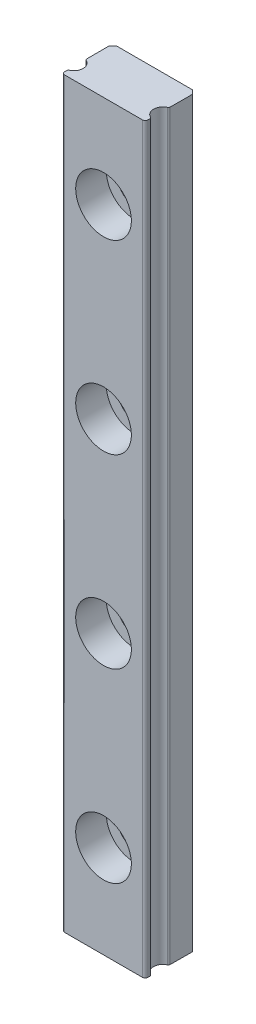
ISO-10303-21;
HEADER;
FILE_DESCRIPTION(('STEP AP214'),'2;1');
FILE_NAME('part.step','',(''),(''),'','','');
FILE_SCHEMA(('AUTOMOTIVE_DESIGN { 1 0 10303 214 1 1 1 1 }'));
ENDSEC;
DATA;
#1=APPLICATION_CONTEXT('core data for automotive mechanical design processes');
#2=APPLICATION_PROTOCOL_DEFINITION('international standard','automotive_design',2000,#1);
#3=PRODUCT_CONTEXT('',#1,'mechanical');
#4=PRODUCT('Part','Part','',(#3));
#5=PRODUCT_RELATED_PRODUCT_CATEGORY('part','',(#4));
#6=PRODUCT_DEFINITION_FORMATION('','',#4);
#7=PRODUCT_DEFINITION_CONTEXT('part definition',#1,'design');
#8=PRODUCT_DEFINITION('design','',#6,#7);
#9=PRODUCT_DEFINITION_SHAPE('','',#8);
#10=(LENGTH_UNIT() NAMED_UNIT(*) SI_UNIT(.MILLI.,.METRE.));
#11=(NAMED_UNIT(*) PLANE_ANGLE_UNIT() SI_UNIT($,.RADIAN.));
#12=(NAMED_UNIT(*) SI_UNIT($,.STERADIAN.) SOLID_ANGLE_UNIT());
#13=UNCERTAINTY_MEASURE_WITH_UNIT(LENGTH_MEASURE(1.E-05),#10,'distance_accuracy_value','');
#14=(GEOMETRIC_REPRESENTATION_CONTEXT(3) GLOBAL_UNCERTAINTY_ASSIGNED_CONTEXT((#13)) GLOBAL_UNIT_ASSIGNED_CONTEXT((#10,
#11,#12)) REPRESENTATION_CONTEXT('',''));
#15=CARTESIAN_POINT('',(0.,0.,0.));
#16=DIRECTION('',(0.,0.,1.));
#17=DIRECTION('',(1.,0.,0.));
#18=AXIS2_PLACEMENT_3D('',#15,#16,#17);
#19=CARTESIAN_POINT('',(55.5125,80.,4.99185481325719));
#20=DIRECTION('',(1.,0.,0.));
#21=DIRECTION('',(0.,0.,-1.));
#22=AXIS2_PLACEMENT_3D('',#19,#20,#21);
#23=PLANE('',#22);
#24=DIRECTION('',(0.,-1.,0.));
#25=VECTOR('',#24,1.);
#26=CARTESIAN_POINT('',(55.5125,80.,5.2));
#27=LINE('',#26,#25);
#28=CARTESIAN_POINT('',(55.5125,80.,5.2));
#29=VERTEX_POINT('',#28);
#30=CARTESIAN_POINT('',(55.5125,0.,5.2));
#31=VERTEX_POINT('',#30);
#32=EDGE_CURVE('E454',#29,#31,#27,.T.);
#33=ORIENTED_EDGE('',*,*,#32,.F.);
#34=DIRECTION('',(0.,0.,-1.));
#35=VECTOR('',#34,1.);
#36=CARTESIAN_POINT('',(55.5125,80.,4.99185481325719));
#37=LINE('',#36,#35);
#38=CARTESIAN_POINT('',(55.5125,80.,4.99185481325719));
#39=VERTEX_POINT('',#38);
#40=EDGE_CURVE('E515',#39,#29,#37,.F.);
#41=ORIENTED_EDGE('',*,*,#40,.F.);
#42=DIRECTION('',(0.,-1.,0.));
#43=VECTOR('',#42,1.);
#44=CARTESIAN_POINT('',(55.5125,80.,4.99185481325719));
#45=LINE('',#44,#43);
#46=CARTESIAN_POINT('',(55.5125,0.,4.99185481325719));
#47=VERTEX_POINT('',#46);
#48=EDGE_CURVE('E527',#47,#39,#45,.F.);
#49=ORIENTED_EDGE('',*,*,#48,.F.);
#50=DIRECTION('',(0.,0.,-1.));
#51=VECTOR('',#50,1.);
#52=CARTESIAN_POINT('',(55.5125,0.,4.99185481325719));
#53=LINE('',#52,#51);
#54=EDGE_CURVE('E465',#31,#47,#53,.T.);
#55=ORIENTED_EDGE('',*,*,#54,.F.);
#56=EDGE_LOOP('',(#33,#41,#49,#55));
#57=FACE_BOUND('',#56,.T.);
#58=ADVANCED_FACE('F17',(#57),#23,.F.);
#59=CARTESIAN_POINT('',(64.4875,80.,5.2));
#60=DIRECTION('',(-1.,0.,0.));
#61=DIRECTION('',(0.,0.,1.));
#62=AXIS2_PLACEMENT_3D('',#59,#60,#61);
#63=PLANE('',#62);
#64=DIRECTION('',(0.,-1.,0.));
#65=VECTOR('',#64,1.);
#66=CARTESIAN_POINT('',(64.4875,80.,4.99185481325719));
#67=LINE('',#66,#65);
#68=CARTESIAN_POINT('',(64.4875,80.,4.99185481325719));
#69=VERTEX_POINT('',#68);
#70=CARTESIAN_POINT('',(64.4875,0.,4.99185481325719));
#71=VERTEX_POINT('',#70);
#72=EDGE_CURVE('E268',#69,#71,#67,.T.);
#73=ORIENTED_EDGE('',*,*,#72,.F.);
#74=DIRECTION('',(0.,0.,1.));
#75=VECTOR('',#74,1.);
#76=CARTESIAN_POINT('',(64.4875,80.,5.2));
#77=LINE('',#76,#75);
#78=CARTESIAN_POINT('',(64.4875,80.,5.2));
#79=VERTEX_POINT('',#78);
#80=EDGE_CURVE('E461',#79,#69,#77,.F.);
#81=ORIENTED_EDGE('',*,*,#80,.F.);
#82=DIRECTION('',(0.,-1.,0.));
#83=VECTOR('',#82,1.);
#84=CARTESIAN_POINT('',(64.4875,80.,5.2));
#85=LINE('',#84,#83);
#86=CARTESIAN_POINT('',(64.4875,0.,5.2));
#87=VERTEX_POINT('',#86);
#88=EDGE_CURVE('E446',#87,#79,#85,.F.);
#89=ORIENTED_EDGE('',*,*,#88,.F.);
#90=DIRECTION('',(0.,0.,1.));
#91=VECTOR('',#90,1.);
#92=CARTESIAN_POINT('',(64.4875,0.,5.2));
#93=LINE('',#92,#91);
#94=EDGE_CURVE('E464',#71,#87,#93,.T.);
#95=ORIENTED_EDGE('',*,*,#94,.F.);
#96=EDGE_LOOP('',(#73,#81,#89,#95));
#97=FACE_BOUND('',#96,.T.);
#98=ADVANCED_FACE('F713',(#97),#63,.F.);
#99=CARTESIAN_POINT('',(64.2875,80.,4.99185481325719));
#100=DIRECTION('',(0.,-1.,0.));
#101=DIRECTION('',(0.,0.,-1.));
#102=AXIS2_PLACEMENT_3D('',#99,#100,#101);
#103=CYLINDRICAL_SURFACE('',#102,0.2);
#104=CARTESIAN_POINT('',(64.2875,80.,4.99185481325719));
#105=DIRECTION('',(0.,-1.,0.));
#106=DIRECTION('',(0.424904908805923,0.,-0.905237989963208));
#107=AXIS2_PLACEMENT_3D('',#104,#105,#106);
#108=CIRCLE('',#107,0.2);
#109=CARTESIAN_POINT('',(64.3724809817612,80.,4.81080721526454));
#110=VERTEX_POINT('',#109);
#111=EDGE_CURVE('E263',#110,#69,#108,.T.);
#112=ORIENTED_EDGE('',*,*,#111,.T.);
#113=ORIENTED_EDGE('',*,*,#72,.T.);
#114=CARTESIAN_POINT('',(64.2875,0.,4.99185481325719));
#115=DIRECTION('',(0.,1.,0.));
#116=DIRECTION('',(1.,0.,0.));
#117=AXIS2_PLACEMENT_3D('',#114,#115,#116);
#118=CIRCLE('',#117,0.200000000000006);
#119=CARTESIAN_POINT('',(64.3724809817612,0.,4.81080721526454));
#120=VERTEX_POINT('',#119);
#121=EDGE_CURVE('E280',#71,#120,#118,.T.);
#122=ORIENTED_EDGE('',*,*,#121,.T.);
#123=DIRECTION('',(0.,-1.,0.));
#124=VECTOR('',#123,1.);
#125=CARTESIAN_POINT('',(64.3724809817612,80.,4.81080721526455));
#126=LINE('',#125,#124);
#127=EDGE_CURVE('E440',#120,#110,#126,.F.);
#128=ORIENTED_EDGE('',*,*,#127,.T.);
#129=EDGE_LOOP('',(#112,#113,#122,#128));
#130=FACE_BOUND('',#129,.T.);
#131=ADVANCED_FACE('F231',(#130),#103,.T.);
#132=CARTESIAN_POINT('',(64.2875,80.,2.80814518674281));
#133=DIRECTION('',(0.,-1.,0.));
#134=DIRECTION('',(0.,0.,-1.));
#135=AXIS2_PLACEMENT_3D('',#132,#133,#134);
#136=CYLINDRICAL_SURFACE('',#135,0.2);
#137=CARTESIAN_POINT('',(64.2875,80.,2.80814518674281));
#138=DIRECTION('',(0.,-1.,0.));
#139=DIRECTION('',(1.,0.,0.));
#140=AXIS2_PLACEMENT_3D('',#137,#138,#139);
#141=CIRCLE('',#140,0.200000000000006);
#142=CARTESIAN_POINT('',(64.49375,80.,2.80814518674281));
#143=VERTEX_POINT('',#142);
#144=CARTESIAN_POINT('',(64.3724809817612,80.,2.98919278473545));
#145=VERTEX_POINT('',#144);
#146=EDGE_CURVE('E571',#143,#145,#141,.T.);
#147=ORIENTED_EDGE('',*,*,#146,.T.);
#148=DIRECTION('',(0.,-1.,0.));
#149=VECTOR('',#148,1.);
#150=CARTESIAN_POINT('',(64.3724809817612,80.,2.98919278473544));
#151=LINE('',#150,#149);
#152=CARTESIAN_POINT('',(64.3724809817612,0.,2.98919278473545));
#153=VERTEX_POINT('',#152);
#154=EDGE_CURVE('E437',#145,#153,#151,.T.);
#155=ORIENTED_EDGE('',*,*,#154,.T.);
#156=CARTESIAN_POINT('',(64.2875,0.,2.80814518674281));
#157=DIRECTION('',(0.,1.,0.));
#158=DIRECTION('',(0.424904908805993,0.,0.905237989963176));
#159=AXIS2_PLACEMENT_3D('',#156,#157,#158);
#160=CIRCLE('',#159,0.2);
#161=CARTESIAN_POINT('',(64.49375,0.,2.80814518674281));
#162=VERTEX_POINT('',#161);
#163=EDGE_CURVE('E250',#153,#162,#160,.T.);
#164=ORIENTED_EDGE('',*,*,#163,.T.);
#165=CARTESIAN_POINT('',(64.4875,0.,2.80814518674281));
#166=DIRECTION('',(0.,1.,0.));
#167=VECTOR('',#166,1.);
#168=LINE('',#165,#167);
#169=EDGE_CURVE('E213',#162,#143,#168,.T.);
#170=ORIENTED_EDGE('',*,*,#169,.T.);
#171=EDGE_LOOP('',(#147,#155,#164,#170));
#172=FACE_BOUND('',#171,.T.);
#173=ADVANCED_FACE('F220',(#172),#136,.T.);
#174=CARTESIAN_POINT('',(55.7125,80.,2.80814518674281));
#175=DIRECTION('',(0.,-1.,0.));
#176=DIRECTION('',(0.,0.,-1.));
#177=AXIS2_PLACEMENT_3D('',#174,#175,#176);
#178=CYLINDRICAL_SURFACE('',#177,0.2);
#179=CARTESIAN_POINT('',(55.7125,80.,2.80814518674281));
#180=DIRECTION('',(0.,-1.,0.));
#181=DIRECTION('',(-0.424904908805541,0.,0.905237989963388));
#182=AXIS2_PLACEMENT_3D('',#179,#180,#181);
#183=CIRCLE('',#182,0.2);
#184=CARTESIAN_POINT('',(55.6275190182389,80.,2.98919278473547));
#185=VERTEX_POINT('',#184);
#186=CARTESIAN_POINT('',(55.50625,80.,2.80814518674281));
#187=VERTEX_POINT('',#186);
#188=EDGE_CURVE('E549',#185,#187,#183,.T.);
#189=ORIENTED_EDGE('',*,*,#188,.T.);
#190=CARTESIAN_POINT('',(55.5125,80.,2.80814518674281));
#191=DIRECTION('',(0.,-1.,0.));
#192=VECTOR('',#191,1.);
#193=LINE('',#190,#192);
#194=CARTESIAN_POINT('',(55.50625,0.,2.80814518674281));
#195=VERTEX_POINT('',#194);
#196=EDGE_CURVE('E133',#187,#195,#193,.T.);
#197=ORIENTED_EDGE('',*,*,#196,.T.);
#198=CARTESIAN_POINT('',(55.7125,0.,2.80814518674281));
#199=DIRECTION('',(0.,1.,0.));
#200=DIRECTION('',(-1.,0.,0.));
#201=AXIS2_PLACEMENT_3D('',#198,#199,#200);
#202=CIRCLE('',#201,0.199999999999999);
#203=CARTESIAN_POINT('',(55.6275190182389,0.,2.98919278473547));
#204=VERTEX_POINT('',#203);
#205=EDGE_CURVE('E558',#195,#204,#202,.T.);
#206=ORIENTED_EDGE('',*,*,#205,.T.);
#207=DIRECTION('',(0.,-1.,0.));
#208=VECTOR('',#207,1.);
#209=CARTESIAN_POINT('',(55.6275190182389,80.,2.98919278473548));
#210=LINE('',#209,#208);
#211=EDGE_CURVE('E409',#204,#185,#210,.F.);
#212=ORIENTED_EDGE('',*,*,#211,.T.);
#213=EDGE_LOOP('',(#189,#197,#206,#212));
#214=FACE_BOUND('',#213,.T.);
#215=ADVANCED_FACE('F230',(#214),#178,.T.);
#216=CARTESIAN_POINT('',(55.7125,80.,4.99185481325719));
#217=DIRECTION('',(0.,-1.,0.));
#218=DIRECTION('',(0.,0.,-1.));
#219=AXIS2_PLACEMENT_3D('',#216,#217,#218);
#220=CYLINDRICAL_SURFACE('',#219,0.2);
#221=CARTESIAN_POINT('',(55.7125,80.,4.99185481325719));
#222=DIRECTION('',(0.,-1.,0.));
#223=DIRECTION('',(-1.,0.,0.));
#224=AXIS2_PLACEMENT_3D('',#221,#222,#223);
#225=CIRCLE('',#224,0.199999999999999);
#226=CARTESIAN_POINT('',(55.6275190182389,80.,4.81080721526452));
#227=VERTEX_POINT('',#226);
#228=EDGE_CURVE('E522',#39,#227,#225,.T.);
#229=ORIENTED_EDGE('',*,*,#228,.T.);
#230=DIRECTION('',(0.,-1.,0.));
#231=VECTOR('',#230,1.);
#232=CARTESIAN_POINT('',(55.6275190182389,80.,4.81080721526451));
#233=LINE('',#232,#231);
#234=CARTESIAN_POINT('',(55.6275190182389,0.,4.81080721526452));
#235=VERTEX_POINT('',#234);
#236=EDGE_CURVE('E399',#227,#235,#233,.T.);
#237=ORIENTED_EDGE('',*,*,#236,.T.);
#238=CARTESIAN_POINT('',(55.7125,0.,4.99185481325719));
#239=DIRECTION('',(0.,1.,0.));
#240=DIRECTION('',(-0.424904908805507,0.,-0.905237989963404));
#241=AXIS2_PLACEMENT_3D('',#238,#239,#240);
#242=CIRCLE('',#241,0.2);
#243=EDGE_CURVE('E535',#235,#47,#242,.T.);
#244=ORIENTED_EDGE('',*,*,#243,.T.);
#245=ORIENTED_EDGE('',*,*,#48,.T.);
#246=EDGE_LOOP('',(#229,#237,#244,#245));
#247=FACE_BOUND('',#246,.T.);
#248=ADVANCED_FACE('F494',(#247),#220,.T.);
#249=CARTESIAN_POINT('',(55.8125,80.,5.2));
#250=DIRECTION('',(0.,-1.,0.));
#251=DIRECTION('',(0.,0.,-1.));
#252=AXIS2_PLACEMENT_3D('',#249,#250,#251);
#253=CYLINDRICAL_SURFACE('',#252,0.3);
#254=CARTESIAN_POINT('',(55.8125,80.,5.2));
#255=DIRECTION('',(0.,-1.,0.));
#256=DIRECTION('',(0.,0.,1.));
#257=AXIS2_PLACEMENT_3D('',#254,#255,#256);
#258=CIRCLE('',#257,0.3);
#259=CARTESIAN_POINT('',(55.8125,80.,5.5));
#260=VERTEX_POINT('',#259);
#261=EDGE_CURVE('E627',#260,#29,#258,.T.);
#262=ORIENTED_EDGE('',*,*,#261,.T.);
#263=ORIENTED_EDGE('',*,*,#32,.T.);
#264=CARTESIAN_POINT('',(55.8125,0.,5.2));
#265=DIRECTION('',(0.,1.,0.));
#266=DIRECTION('',(-1.,0.,0.));
#267=AXIS2_PLACEMENT_3D('',#264,#265,#266);
#268=CIRCLE('',#267,0.300000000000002);
#269=CARTESIAN_POINT('',(55.8125,0.,5.5));
#270=VERTEX_POINT('',#269);
#271=EDGE_CURVE('E666',#31,#270,#268,.T.);
#272=ORIENTED_EDGE('',*,*,#271,.T.);
#273=DIRECTION('',(0.,1.,0.));
#274=VECTOR('',#273,1.);
#275=CARTESIAN_POINT('',(55.8125,80.,5.5));
#276=LINE('',#275,#274);
#277=EDGE_CURVE('E392',#270,#260,#276,.T.);
#278=ORIENTED_EDGE('',*,*,#277,.T.);
#279=EDGE_LOOP('',(#262,#263,#272,#278));
#280=FACE_BOUND('',#279,.T.);
#281=ADVANCED_FACE('F489',(#280),#253,.T.);
#282=CARTESIAN_POINT('',(64.1875,80.,5.2));
#283=DIRECTION('',(0.,-1.,0.));
#284=DIRECTION('',(0.,0.,-1.));
#285=AXIS2_PLACEMENT_3D('',#282,#283,#284);
#286=CYLINDRICAL_SURFACE('',#285,0.3);
#287=CARTESIAN_POINT('',(64.1875,80.,5.2));
#288=DIRECTION('',(0.,-1.,0.));
#289=DIRECTION('',(1.,0.,0.));
#290=AXIS2_PLACEMENT_3D('',#287,#288,#289);
#291=CIRCLE('',#290,0.299999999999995);
#292=CARTESIAN_POINT('',(64.1875,80.,5.5));
#293=VERTEX_POINT('',#292);
#294=EDGE_CURVE('E443',#79,#293,#291,.T.);
#295=ORIENTED_EDGE('',*,*,#294,.T.);
#296=DIRECTION('',(0.,1.,0.));
#297=VECTOR('',#296,1.);
#298=CARTESIAN_POINT('',(64.1875,80.,5.5));
#299=LINE('',#298,#297);
#300=CARTESIAN_POINT('',(64.1875,0.,5.5));
#301=VERTEX_POINT('',#300);
#302=EDGE_CURVE('E387',#293,#301,#299,.F.);
#303=ORIENTED_EDGE('',*,*,#302,.T.);
#304=CARTESIAN_POINT('',(64.1875,0.,5.2));
#305=DIRECTION('',(0.,1.,0.));
#306=DIRECTION('',(0.,0.,1.));
#307=AXIS2_PLACEMENT_3D('',#304,#305,#306);
#308=CIRCLE('',#307,0.3);
#309=EDGE_CURVE('E450',#301,#87,#308,.T.);
#310=ORIENTED_EDGE('',*,*,#309,.T.);
#311=ORIENTED_EDGE('',*,*,#88,.T.);
#312=EDGE_LOOP('',(#295,#303,#310,#311));
#313=FACE_BOUND('',#312,.T.);
#314=ADVANCED_FACE('F478',(#313),#286,.T.);
#315=CARTESIAN_POINT('',(60.,70.,5.5));
#316=DIRECTION('',(0.,0.,-1.));
#317=DIRECTION('',(-1.,0.,0.));
#318=AXIS2_PLACEMENT_3D('',#315,#316,#317);
#319=CYLINDRICAL_SURFACE('',#318,3.);
#320=CARTESIAN_POINT('',(60.,70.,2.2));
#321=DIRECTION('',(0.,0.,-1.));
#322=DIRECTION('',(-1.,0.,0.));
#323=AXIS2_PLACEMENT_3D('',#320,#321,#322);
#324=CIRCLE('',#323,3.);
#325=CARTESIAN_POINT('',(57.,70.,2.2));
#326=VERTEX_POINT('',#325);
#327=EDGE_CURVE('E369',#326,#326,#324,.F.);
#328=ORIENTED_EDGE('',*,*,#327,.F.);
#329=EDGE_LOOP('',(#328));
#330=FACE_BOUND('',#329,.T.);
#331=CARTESIAN_POINT('',(60.,70.,5.5));
#332=DIRECTION('',(0.,0.,-1.));
#333=DIRECTION('',(-1.,0.,0.));
#334=AXIS2_PLACEMENT_3D('',#331,#332,#333);
#335=CIRCLE('',#334,3.);
#336=CARTESIAN_POINT('',(57.,70.,5.5));
#337=VERTEX_POINT('',#336);
#338=EDGE_CURVE('E377',#337,#337,#335,.F.);
#339=ORIENTED_EDGE('',*,*,#338,.T.);
#340=EDGE_LOOP('',(#339));
#341=FACE_BOUND('',#340,.T.);
#342=ADVANCED_FACE('F488',(#330,#341),#319,.F.);
#343=CARTESIAN_POINT('',(60.,30.,5.5));
#344=DIRECTION('',(0.,0.,-1.));
#345=DIRECTION('',(-1.,0.,0.));
#346=AXIS2_PLACEMENT_3D('',#343,#344,#345);
#347=CYLINDRICAL_SURFACE('',#346,3.);
#348=CARTESIAN_POINT('',(60.,30.,2.2));
#349=DIRECTION('',(0.,0.,-1.));
#350=DIRECTION('',(-1.,0.,0.));
#351=AXIS2_PLACEMENT_3D('',#348,#349,#350);
#352=CIRCLE('',#351,3.);
#353=CARTESIAN_POINT('',(57.,30.,2.2));
#354=VERTEX_POINT('',#353);
#355=EDGE_CURVE('E365',#354,#354,#352,.F.);
#356=ORIENTED_EDGE('',*,*,#355,.F.);
#357=EDGE_LOOP('',(#356));
#358=FACE_BOUND('',#357,.T.);
#359=CARTESIAN_POINT('',(60.,30.,5.5));
#360=DIRECTION('',(0.,0.,-1.));
#361=DIRECTION('',(-1.,0.,0.));
#362=AXIS2_PLACEMENT_3D('',#359,#360,#361);
#363=CIRCLE('',#362,3.);
#364=CARTESIAN_POINT('',(57.,30.,5.5));
#365=VERTEX_POINT('',#364);
#366=EDGE_CURVE('E380',#365,#365,#363,.F.);
#367=ORIENTED_EDGE('',*,*,#366,.T.);
#368=EDGE_LOOP('',(#367));
#369=FACE_BOUND('',#368,.T.);
#370=ADVANCED_FACE('F790',(#358,#369),#347,.F.);
#371=CARTESIAN_POINT('',(60.,9.99999999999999,5.5));
#372=DIRECTION('',(0.,0.,-1.));
#373=DIRECTION('',(-1.,0.,0.));
#374=AXIS2_PLACEMENT_3D('',#371,#372,#373);
#375=CYLINDRICAL_SURFACE('',#374,3.);
#376=CARTESIAN_POINT('',(60.,9.99999999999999,2.2));
#377=DIRECTION('',(0.,0.,-1.));
#378=DIRECTION('',(-1.,0.,0.));
#379=AXIS2_PLACEMENT_3D('',#376,#377,#378);
#380=CIRCLE('',#379,3.);
#381=CARTESIAN_POINT('',(57.,9.99999999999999,2.2));
#382=VERTEX_POINT('',#381);
#383=EDGE_CURVE('E361',#382,#382,#380,.F.);
#384=ORIENTED_EDGE('',*,*,#383,.F.);
#385=EDGE_LOOP('',(#384));
#386=FACE_BOUND('',#385,.T.);
#387=CARTESIAN_POINT('',(60.,9.99999999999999,5.5));
#388=DIRECTION('',(0.,0.,-1.));
#389=DIRECTION('',(-1.,0.,0.));
#390=AXIS2_PLACEMENT_3D('',#387,#388,#389);
#391=CIRCLE('',#390,3.);
#392=CARTESIAN_POINT('',(57.,9.99999999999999,5.5));
#393=VERTEX_POINT('',#392);
#394=EDGE_CURVE('E20',#393,#393,#391,.F.);
#395=ORIENTED_EDGE('',*,*,#394,.T.);
#396=EDGE_LOOP('',(#395));
#397=FACE_BOUND('',#396,.T.);
#398=ADVANCED_FACE('F795',(#386,#397),#375,.F.);
#399=CARTESIAN_POINT('',(60.,50.,5.5));
#400=DIRECTION('',(0.,0.,-1.));
#401=DIRECTION('',(-1.,0.,0.));
#402=AXIS2_PLACEMENT_3D('',#399,#400,#401);
#403=CYLINDRICAL_SURFACE('',#402,3.);
#404=CARTESIAN_POINT('',(60.,50.,2.2));
#405=DIRECTION('',(0.,0.,-1.));
#406=DIRECTION('',(-1.,0.,0.));
#407=AXIS2_PLACEMENT_3D('',#404,#405,#406);
#408=CIRCLE('',#407,3.);
#409=CARTESIAN_POINT('',(57.,50.,2.2));
#410=VERTEX_POINT('',#409);
#411=EDGE_CURVE('E357',#410,#410,#408,.F.);
#412=ORIENTED_EDGE('',*,*,#411,.F.);
#413=EDGE_LOOP('',(#412));
#414=FACE_BOUND('',#413,.T.);
#415=CARTESIAN_POINT('',(60.,50.,5.5));
#416=DIRECTION('',(0.,0.,-1.));
#417=DIRECTION('',(-1.,0.,0.));
#418=AXIS2_PLACEMENT_3D('',#415,#416,#417);
#419=CIRCLE('',#418,3.);
#420=CARTESIAN_POINT('',(57.,50.,5.5));
#421=VERTEX_POINT('',#420);
#422=EDGE_CURVE('E373',#421,#421,#419,.F.);
#423=ORIENTED_EDGE('',*,*,#422,.T.);
#424=EDGE_LOOP('',(#423));
#425=FACE_BOUND('',#424,.T.);
#426=ADVANCED_FACE('F802',(#414,#425),#403,.F.);
#427=CARTESIAN_POINT('',(64.8,80.,3.9));
#428=DIRECTION('',(0.,-1.,0.));
#429=DIRECTION('',(0.,0.,-1.));
#430=AXIS2_PLACEMENT_3D('',#427,#428,#429);
#431=CYLINDRICAL_SURFACE('',#430,1.00615222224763);
#432=ORIENTED_EDGE('',*,*,#154,.F.);
#433=CARTESIAN_POINT('',(64.8,80.,3.9));
#434=DIRECTION('',(0.,-1.,0.));
#435=DIRECTION('',(0.,0.,-1.));
#436=AXIS2_PLACEMENT_3D('',#433,#434,#435);
#437=CIRCLE('',#436,1.00615222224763);
#438=EDGE_CURVE('E348',#110,#145,#437,.T.);
#439=ORIENTED_EDGE('',*,*,#438,.F.);
#440=ORIENTED_EDGE('',*,*,#127,.F.);
#441=CARTESIAN_POINT('',(64.8,0.,3.9));
#442=DIRECTION('',(0.,-1.,0.));
#443=DIRECTION('',(0.,0.,-1.));
#444=AXIS2_PLACEMENT_3D('',#441,#442,#443);
#445=CIRCLE('',#444,1.00615222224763);
#446=EDGE_CURVE('E147',#120,#153,#445,.T.);
#447=ORIENTED_EDGE('',*,*,#446,.T.);
#448=EDGE_LOOP('',(#432,#439,#440,#447));
#449=FACE_BOUND('',#448,.T.);
#450=ADVANCED_FACE('F196',(#449),#431,.F.);
#451=CARTESIAN_POINT('',(64.5,80.,2.80814518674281));
#452=DIRECTION('',(-1.,0.,0.));
#453=DIRECTION('',(0.,0.,1.));
#454=AXIS2_PLACEMENT_3D('',#451,#452,#453);
#455=PLANE('',#454);
#456=DIRECTION('',(0.,1.,0.));
#457=VECTOR('',#456,1.);
#458=CARTESIAN_POINT('',(64.5,80.,0.412499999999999));
#459=LINE('',#458,#457);
#460=CARTESIAN_POINT('',(64.5,0.,0.412499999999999));
#461=VERTEX_POINT('',#460);
#462=CARTESIAN_POINT('',(64.5,80.,0.412499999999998));
#463=VERTEX_POINT('',#462);
#464=EDGE_CURVE('E354',#461,#463,#459,.T.);
#465=ORIENTED_EDGE('',*,*,#464,.T.);
#466=DIRECTION('',(0.,0.,-1.));
#467=VECTOR('',#466,1.);
#468=CARTESIAN_POINT('',(64.5,80.,2.80814518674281));
#469=LINE('',#468,#467);
#470=EDGE_CURVE('E174',#143,#463,#469,.T.);
#471=ORIENTED_EDGE('',*,*,#470,.F.);
#472=ORIENTED_EDGE('',*,*,#169,.F.);
#473=DIRECTION('',(0.,0.,1.));
#474=VECTOR('',#473,1.);
#475=CARTESIAN_POINT('',(64.5,0.,2.80814518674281));
#476=LINE('',#475,#474);
#477=EDGE_CURVE('E326',#162,#461,#476,.F.);
#478=ORIENTED_EDGE('',*,*,#477,.T.);
#479=EDGE_LOOP('',(#465,#471,#472,#478));
#480=FACE_BOUND('',#479,.T.);
#481=ADVANCED_FACE('F191',(#480),#455,.F.);
#482=CARTESIAN_POINT('',(55.5,80.,0.4));
#483=DIRECTION('',(1.,0.,0.));
#484=DIRECTION('',(0.,0.,-1.));
#485=AXIS2_PLACEMENT_3D('',#482,#483,#484);
#486=PLANE('',#485);
#487=ORIENTED_EDGE('',*,*,#196,.F.);
#488=DIRECTION('',(0.,0.,1.));
#489=VECTOR('',#488,1.);
#490=CARTESIAN_POINT('',(55.5,80.,0.4));
#491=LINE('',#490,#489);
#492=CARTESIAN_POINT('',(55.5,80.,0.412500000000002));
#493=VERTEX_POINT('',#492);
#494=EDGE_CURVE('E127',#493,#187,#491,.T.);
#495=ORIENTED_EDGE('',*,*,#494,.F.);
#496=DIRECTION('',(0.,1.,0.));
#497=VECTOR('',#496,1.);
#498=CARTESIAN_POINT('',(55.5,80.,0.412500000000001));
#499=LINE('',#498,#497);
#500=CARTESIAN_POINT('',(55.5,0.,0.412499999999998));
#501=VERTEX_POINT('',#500);
#502=EDGE_CURVE('E131',#493,#501,#499,.F.);
#503=ORIENTED_EDGE('',*,*,#502,.T.);
#504=DIRECTION('',(0.,0.,1.));
#505=VECTOR('',#504,1.);
#506=CARTESIAN_POINT('',(55.5,0.,4.99185481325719));
#507=LINE('',#506,#505);
#508=EDGE_CURVE('E323',#501,#195,#507,.T.);
#509=ORIENTED_EDGE('',*,*,#508,.T.);
#510=EDGE_LOOP('',(#487,#495,#503,#509));
#511=FACE_BOUND('',#510,.T.);
#512=ADVANCED_FACE('F129',(#511),#486,.F.);
#513=CARTESIAN_POINT('',(55.2,80.,3.9));
#514=DIRECTION('',(0.,-1.,0.));
#515=DIRECTION('',(0.,0.,-1.));
#516=AXIS2_PLACEMENT_3D('',#513,#514,#515);
#517=CYLINDRICAL_SURFACE('',#516,1.00615222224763);
#518=ORIENTED_EDGE('',*,*,#236,.F.);
#519=CARTESIAN_POINT('',(55.2,80.,3.9));
#520=DIRECTION('',(0.,-1.,0.));
#521=DIRECTION('',(0.,0.,-1.));
#522=AXIS2_PLACEMENT_3D('',#519,#520,#521);
#523=CIRCLE('',#522,1.00615222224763);
#524=EDGE_CURVE('E138',#185,#227,#523,.T.);
#525=ORIENTED_EDGE('',*,*,#524,.F.);
#526=ORIENTED_EDGE('',*,*,#211,.F.);
#527=CARTESIAN_POINT('',(55.2,0.,3.9));
#528=DIRECTION('',(0.,-1.,0.));
#529=DIRECTION('',(0.,0.,-1.));
#530=AXIS2_PLACEMENT_3D('',#527,#528,#529);
#531=CIRCLE('',#530,1.00615222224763);
#532=EDGE_CURVE('E319',#204,#235,#531,.T.);
#533=ORIENTED_EDGE('',*,*,#532,.T.);
#534=EDGE_LOOP('',(#518,#525,#526,#533));
#535=FACE_BOUND('',#534,.T.);
#536=ADVANCED_FACE('F190',(#535),#517,.F.);
#537=CARTESIAN_POINT('',(55.8125,80.,5.5));
#538=DIRECTION('',(0.,0.,-1.));
#539=DIRECTION('',(-1.,0.,0.));
#540=AXIS2_PLACEMENT_3D('',#537,#538,#539);
#541=PLANE('',#540);
#542=ORIENTED_EDGE('',*,*,#422,.F.);
#543=EDGE_LOOP('',(#542));
#544=FACE_BOUND('',#543,.T.);
#545=ORIENTED_EDGE('',*,*,#338,.F.);
#546=EDGE_LOOP('',(#545));
#547=FACE_BOUND('',#546,.T.);
#548=ORIENTED_EDGE('',*,*,#366,.F.);
#549=EDGE_LOOP('',(#548));
#550=FACE_BOUND('',#549,.T.);
#551=ORIENTED_EDGE('',*,*,#394,.F.);
#552=EDGE_LOOP('',(#551));
#553=FACE_BOUND('',#552,.T.);
#554=ORIENTED_EDGE('',*,*,#302,.F.);
#555=DIRECTION('',(1.,0.,0.));
#556=VECTOR('',#555,1.);
#557=CARTESIAN_POINT('',(64.2875,80.,5.5));
#558=LINE('',#557,#556);
#559=EDGE_CURVE('E156',#260,#293,#558,.T.);
#560=ORIENTED_EDGE('',*,*,#559,.F.);
#561=ORIENTED_EDGE('',*,*,#277,.F.);
#562=DIRECTION('',(1.,0.,0.));
#563=VECTOR('',#562,1.);
#564=CARTESIAN_POINT('',(64.2875,0.,5.5));
#565=LINE('',#564,#563);
#566=EDGE_CURVE('E318',#270,#301,#565,.T.);
#567=ORIENTED_EDGE('',*,*,#566,.T.);
#568=EDGE_LOOP('',(#554,#560,#561,#567));
#569=FACE_BOUND('',#568,.T.);
#570=ADVANCED_FACE('F639',(#544,#547,#550,#553,#569),#541,.F.);
#571=CARTESIAN_POINT('',(60.,70.,2.2));
#572=DIRECTION('',(0.,0.,1.));
#573=DIRECTION('',(1.,0.,0.));
#574=AXIS2_PLACEMENT_3D('',#571,#572,#573);
#575=PLANE('',#574);
#576=CARTESIAN_POINT('',(60.,70.,2.2));
#577=DIRECTION('',(0.,0.,1.));
#578=DIRECTION('',(1.,0.,0.));
#579=AXIS2_PLACEMENT_3D('',#576,#577,#578);
#580=CIRCLE('',#579,1.75);
#581=CARTESIAN_POINT('',(61.75,70.,2.2));
#582=VERTEX_POINT('',#581);
#583=EDGE_CURVE('E314',#582,#582,#580,.F.);
#584=ORIENTED_EDGE('',*,*,#583,.T.);
#585=EDGE_LOOP('',(#584));
#586=FACE_BOUND('',#585,.T.);
#587=ORIENTED_EDGE('',*,*,#327,.T.);
#588=EDGE_LOOP('',(#587));
#589=FACE_BOUND('',#588,.T.);
#590=ADVANCED_FACE('F774',(#586,#589),#575,.T.);
#591=CARTESIAN_POINT('',(60.,30.,2.2));
#592=DIRECTION('',(0.,0.,1.));
#593=DIRECTION('',(1.,0.,0.));
#594=AXIS2_PLACEMENT_3D('',#591,#592,#593);
#595=PLANE('',#594);
#596=CARTESIAN_POINT('',(60.,30.,2.2));
#597=DIRECTION('',(0.,0.,1.));
#598=DIRECTION('',(1.,0.,0.));
#599=AXIS2_PLACEMENT_3D('',#596,#597,#598);
#600=CIRCLE('',#599,1.75);
#601=CARTESIAN_POINT('',(61.75,30.,2.2));
#602=VERTEX_POINT('',#601);
#603=EDGE_CURVE('E310',#602,#602,#600,.F.);
#604=ORIENTED_EDGE('',*,*,#603,.T.);
#605=EDGE_LOOP('',(#604));
#606=FACE_BOUND('',#605,.T.);
#607=ORIENTED_EDGE('',*,*,#355,.T.);
#608=EDGE_LOOP('',(#607));
#609=FACE_BOUND('',#608,.T.);
#610=ADVANCED_FACE('F767',(#606,#609),#595,.T.);
#611=CARTESIAN_POINT('',(60.,9.99999999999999,2.2));
#612=DIRECTION('',(0.,0.,1.));
#613=DIRECTION('',(1.,0.,0.));
#614=AXIS2_PLACEMENT_3D('',#611,#612,#613);
#615=PLANE('',#614);
#616=CARTESIAN_POINT('',(60.,10.,2.2));
#617=DIRECTION('',(0.,0.,1.));
#618=DIRECTION('',(1.,0.,0.));
#619=AXIS2_PLACEMENT_3D('',#616,#617,#618);
#620=CIRCLE('',#619,1.75);
#621=CARTESIAN_POINT('',(61.75,10.,2.2));
#622=VERTEX_POINT('',#621);
#623=EDGE_CURVE('E306',#622,#622,#620,.F.);
#624=ORIENTED_EDGE('',*,*,#623,.T.);
#625=EDGE_LOOP('',(#624));
#626=FACE_BOUND('',#625,.T.);
#627=ORIENTED_EDGE('',*,*,#383,.T.);
#628=EDGE_LOOP('',(#627));
#629=FACE_BOUND('',#628,.T.);
#630=ADVANCED_FACE('F762',(#626,#629),#615,.T.);
#631=CARTESIAN_POINT('',(60.,50.,2.2));
#632=DIRECTION('',(0.,0.,1.));
#633=DIRECTION('',(1.,0.,0.));
#634=AXIS2_PLACEMENT_3D('',#631,#632,#633);
#635=PLANE('',#634);
#636=CARTESIAN_POINT('',(60.,50.,2.2));
#637=DIRECTION('',(0.,0.,1.));
#638=DIRECTION('',(1.,0.,0.));
#639=AXIS2_PLACEMENT_3D('',#636,#637,#638);
#640=CIRCLE('',#639,1.75);
#641=CARTESIAN_POINT('',(61.75,50.,2.2));
#642=VERTEX_POINT('',#641);
#643=EDGE_CURVE('E302',#642,#642,#640,.F.);
#644=ORIENTED_EDGE('',*,*,#643,.T.);
#645=EDGE_LOOP('',(#644));
#646=FACE_BOUND('',#645,.T.);
#647=ORIENTED_EDGE('',*,*,#411,.T.);
#648=EDGE_LOOP('',(#647));
#649=FACE_BOUND('',#648,.T.);
#650=ADVANCED_FACE('F758',(#646,#649),#635,.T.);
#651=CARTESIAN_POINT('',(64.4875,80.,0.4));
#652=DIRECTION('',(-0.707106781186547,0.,0.707106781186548));
#653=DIRECTION('',(0.707106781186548,0.,0.707106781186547));
#654=AXIS2_PLACEMENT_3D('',#651,#652,#653);
#655=PLANE('',#654);
#656=DIRECTION('',(0.,1.,0.));
#657=VECTOR('',#656,1.);
#658=CARTESIAN_POINT('',(64.0875,80.,0.));
#659=LINE('',#658,#657);
#660=CARTESIAN_POINT('',(64.0875,0.,0.));
#661=VERTEX_POINT('',#660);
#662=CARTESIAN_POINT('',(64.0875,80.,0.));
#663=VERTEX_POINT('',#662);
#664=EDGE_CURVE('E170',#661,#663,#659,.T.);
#665=ORIENTED_EDGE('',*,*,#664,.T.);
#666=DIRECTION('',(-0.707106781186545,0.,-0.70710678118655));
#667=VECTOR('',#666,1.);
#668=CARTESIAN_POINT('',(64.5,80.,0.412499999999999));
#669=LINE('',#668,#667);
#670=EDGE_CURVE('E139',#463,#663,#669,.T.);
#671=ORIENTED_EDGE('',*,*,#670,.F.);
#672=ORIENTED_EDGE('',*,*,#464,.F.);
#673=DIRECTION('',(-0.707106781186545,0.,-0.70710678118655));
#674=VECTOR('',#673,1.);
#675=CARTESIAN_POINT('',(64.5,0.,0.412499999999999));
#676=LINE('',#675,#674);
#677=EDGE_CURVE('E330',#461,#661,#676,.T.);
#678=ORIENTED_EDGE('',*,*,#677,.T.);
#679=EDGE_LOOP('',(#665,#671,#672,#678));
#680=FACE_BOUND('',#679,.T.);
#681=ADVANCED_FACE('F602',(#680),#655,.F.);
#682=CARTESIAN_POINT('',(64.2875,80.,4.99185481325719));
#683=DIRECTION('',(0.,1.,0.));
#684=DIRECTION('',(0.,0.,1.));
#685=AXIS2_PLACEMENT_3D('',#682,#683,#684);
#686=PLANE('',#685);
#687=ORIENTED_EDGE('',*,*,#559,.T.);
#688=ORIENTED_EDGE('',*,*,#294,.F.);
#689=ORIENTED_EDGE('',*,*,#80,.T.);
#690=ORIENTED_EDGE('',*,*,#111,.F.);
#691=ORIENTED_EDGE('',*,*,#438,.T.);
#692=ORIENTED_EDGE('',*,*,#146,.F.);
#693=ORIENTED_EDGE('',*,*,#470,.T.);
#694=ORIENTED_EDGE('',*,*,#670,.T.);
#695=DIRECTION('',(1.,0.,0.));
#696=VECTOR('',#695,1.);
#697=CARTESIAN_POINT('',(64.0875,80.,0.));
#698=LINE('',#697,#696);
#699=CARTESIAN_POINT('',(55.9125,80.,0.));
#700=VERTEX_POINT('',#699);
#701=EDGE_CURVE('E154',#663,#700,#698,.F.);
#702=ORIENTED_EDGE('',*,*,#701,.T.);
#703=DIRECTION('',(0.707106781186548,0.,-0.707106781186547));
#704=VECTOR('',#703,1.);
#705=CARTESIAN_POINT('',(55.9125,80.,0.));
#706=LINE('',#705,#704);
#707=EDGE_CURVE('E144',#700,#493,#706,.F.);
#708=ORIENTED_EDGE('',*,*,#707,.T.);
#709=ORIENTED_EDGE('',*,*,#494,.T.);
#710=ORIENTED_EDGE('',*,*,#188,.F.);
#711=ORIENTED_EDGE('',*,*,#524,.T.);
#712=ORIENTED_EDGE('',*,*,#228,.F.);
#713=ORIENTED_EDGE('',*,*,#40,.T.);
#714=ORIENTED_EDGE('',*,*,#261,.F.);
#715=EDGE_LOOP('',(#687,#688,#689,#690,#691,#692,#693,#694,#702,#708,#709,#710,#711,#712,#713,#714));
#716=FACE_BOUND('',#715,.T.);
#717=ADVANCED_FACE('F151',(#716),#686,.T.);
#718=CARTESIAN_POINT('',(55.9125,80.,0.));
#719=DIRECTION('',(0.707106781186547,0.,0.707106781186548));
#720=DIRECTION('',(0.707106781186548,0.,-0.707106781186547));
#721=AXIS2_PLACEMENT_3D('',#718,#719,#720);
#722=PLANE('',#721);
#723=ORIENTED_EDGE('',*,*,#502,.F.);
#724=ORIENTED_EDGE('',*,*,#707,.F.);
#725=DIRECTION('',(0.,1.,0.));
#726=VECTOR('',#725,1.);
#727=CARTESIAN_POINT('',(55.9125,80.,0.));
#728=LINE('',#727,#726);
#729=CARTESIAN_POINT('',(55.9125,0.,0.));
#730=VERTEX_POINT('',#729);
#731=EDGE_CURVE('E169',#700,#730,#728,.F.);
#732=ORIENTED_EDGE('',*,*,#731,.T.);
#733=DIRECTION('',(-0.707106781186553,0.,0.707106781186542));
#734=VECTOR('',#733,1.);
#735=CARTESIAN_POINT('',(55.9125,0.,0.));
#736=LINE('',#735,#734);
#737=EDGE_CURVE('E36',#730,#501,#736,.T.);
#738=ORIENTED_EDGE('',*,*,#737,.T.);
#739=EDGE_LOOP('',(#723,#724,#732,#738));
#740=FACE_BOUND('',#739,.T.);
#741=ADVANCED_FACE('F142',(#740),#722,.F.);
#742=CARTESIAN_POINT('',(64.2875,0.,4.99185481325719));
#743=DIRECTION('',(0.,1.,0.));
#744=DIRECTION('',(0.,0.,1.));
#745=AXIS2_PLACEMENT_3D('',#742,#743,#744);
#746=PLANE('',#745);
#747=ORIENTED_EDGE('',*,*,#309,.F.);
#748=ORIENTED_EDGE('',*,*,#566,.F.);
#749=ORIENTED_EDGE('',*,*,#271,.F.);
#750=ORIENTED_EDGE('',*,*,#54,.T.);
#751=ORIENTED_EDGE('',*,*,#243,.F.);
#752=ORIENTED_EDGE('',*,*,#532,.F.);
#753=ORIENTED_EDGE('',*,*,#205,.F.);
#754=ORIENTED_EDGE('',*,*,#508,.F.);
#755=ORIENTED_EDGE('',*,*,#737,.F.);
#756=DIRECTION('',(1.,0.,0.));
#757=VECTOR('',#756,1.);
#758=CARTESIAN_POINT('',(64.0875,0.,0.));
#759=LINE('',#758,#757);
#760=EDGE_CURVE('E301',#730,#661,#759,.T.);
#761=ORIENTED_EDGE('',*,*,#760,.T.);
#762=ORIENTED_EDGE('',*,*,#677,.F.);
#763=ORIENTED_EDGE('',*,*,#477,.F.);
#764=ORIENTED_EDGE('',*,*,#163,.F.);
#765=ORIENTED_EDGE('',*,*,#446,.F.);
#766=ORIENTED_EDGE('',*,*,#121,.F.);
#767=ORIENTED_EDGE('',*,*,#94,.T.);
#768=EDGE_LOOP('',(#747,#748,#749,#750,#751,#752,#753,#754,#755,#761,#762,#763,#764,#765,#766,#767));
#769=FACE_BOUND('',#768,.T.);
#770=ADVANCED_FACE('F573',(#769),#746,.F.);
#771=CARTESIAN_POINT('',(60.,70.,-22.95));
#772=DIRECTION('',(0.,0.,1.));
#773=DIRECTION('',(1.,0.,0.));
#774=AXIS2_PLACEMENT_3D('',#771,#772,#773);
#775=CYLINDRICAL_SURFACE('',#774,1.75);
#776=ORIENTED_EDGE('',*,*,#583,.F.);
#777=EDGE_LOOP('',(#776));
#778=FACE_BOUND('',#777,.T.);
#779=CARTESIAN_POINT('',(60.,70.,0.));
#780=DIRECTION('',(0.,0.,1.));
#781=DIRECTION('',(1.,0.,0.));
#782=AXIS2_PLACEMENT_3D('',#779,#780,#781);
#783=CIRCLE('',#782,1.75);
#784=CARTESIAN_POINT('',(61.75,70.,0.));
#785=VERTEX_POINT('',#784);
#786=EDGE_CURVE('E297',#785,#785,#783,.F.);
#787=ORIENTED_EDGE('',*,*,#786,.T.);
#788=EDGE_LOOP('',(#787));
#789=FACE_BOUND('',#788,.T.);
#790=ADVANCED_FACE('F692',(#778,#789),#775,.F.);
#791=CARTESIAN_POINT('',(60.,30.,-22.95));
#792=DIRECTION('',(0.,0.,1.));
#793=DIRECTION('',(1.,0.,0.));
#794=AXIS2_PLACEMENT_3D('',#791,#792,#793);
#795=CYLINDRICAL_SURFACE('',#794,1.75);
#796=ORIENTED_EDGE('',*,*,#603,.F.);
#797=EDGE_LOOP('',(#796));
#798=FACE_BOUND('',#797,.T.);
#799=CARTESIAN_POINT('',(60.,30.,0.));
#800=DIRECTION('',(0.,0.,1.));
#801=DIRECTION('',(1.,0.,0.));
#802=AXIS2_PLACEMENT_3D('',#799,#800,#801);
#803=CIRCLE('',#802,1.75);
#804=CARTESIAN_POINT('',(61.75,30.,0.));
#805=VERTEX_POINT('',#804);
#806=EDGE_CURVE('E293',#805,#805,#803,.F.);
#807=ORIENTED_EDGE('',*,*,#806,.T.);
#808=EDGE_LOOP('',(#807));
#809=FACE_BOUND('',#808,.T.);
#810=ADVANCED_FACE('F734',(#798,#809),#795,.F.);
#811=CARTESIAN_POINT('',(60.,10.,-22.95));
#812=DIRECTION('',(0.,0.,1.));
#813=DIRECTION('',(1.,0.,0.));
#814=AXIS2_PLACEMENT_3D('',#811,#812,#813);
#815=CYLINDRICAL_SURFACE('',#814,1.75);
#816=ORIENTED_EDGE('',*,*,#623,.F.);
#817=EDGE_LOOP('',(#816));
#818=FACE_BOUND('',#817,.T.);
#819=CARTESIAN_POINT('',(60.,10.,0.));
#820=DIRECTION('',(0.,0.,1.));
#821=DIRECTION('',(1.,0.,0.));
#822=AXIS2_PLACEMENT_3D('',#819,#820,#821);
#823=CIRCLE('',#822,1.75);
#824=CARTESIAN_POINT('',(61.75,10.,0.));
#825=VERTEX_POINT('',#824);
#826=EDGE_CURVE('E27',#825,#825,#823,.F.);
#827=ORIENTED_EDGE('',*,*,#826,.T.);
#828=EDGE_LOOP('',(#827));
#829=FACE_BOUND('',#828,.T.);
#830=ADVANCED_FACE('F727',(#818,#829),#815,.F.);
#831=CARTESIAN_POINT('',(60.,50.,-22.95));
#832=DIRECTION('',(0.,0.,1.));
#833=DIRECTION('',(1.,0.,0.));
#834=AXIS2_PLACEMENT_3D('',#831,#832,#833);
#835=CYLINDRICAL_SURFACE('',#834,1.75);
#836=ORIENTED_EDGE('',*,*,#643,.F.);
#837=EDGE_LOOP('',(#836));
#838=FACE_BOUND('',#837,.T.);
#839=CARTESIAN_POINT('',(60.,50.,0.));
#840=DIRECTION('',(0.,0.,1.));
#841=DIRECTION('',(1.,0.,0.));
#842=AXIS2_PLACEMENT_3D('',#839,#840,#841);
#843=CIRCLE('',#842,1.75);
#844=CARTESIAN_POINT('',(61.75,50.,0.));
#845=VERTEX_POINT('',#844);
#846=EDGE_CURVE('E11',#845,#845,#843,.F.);
#847=ORIENTED_EDGE('',*,*,#846,.T.);
#848=EDGE_LOOP('',(#847));
#849=FACE_BOUND('',#848,.T.);
#850=ADVANCED_FACE('F721',(#838,#849),#835,.F.);
#851=CARTESIAN_POINT('',(64.0875,80.,0.));
#852=DIRECTION('',(0.,0.,1.));
#853=DIRECTION('',(1.,0.,0.));
#854=AXIS2_PLACEMENT_3D('',#851,#852,#853);
#855=PLANE('',#854);
#856=ORIENTED_EDGE('',*,*,#846,.F.);
#857=EDGE_LOOP('',(#856));
#858=FACE_BOUND('',#857,.T.);
#859=ORIENTED_EDGE('',*,*,#826,.F.);
#860=EDGE_LOOP('',(#859));
#861=FACE_BOUND('',#860,.T.);
#862=ORIENTED_EDGE('',*,*,#806,.F.);
#863=EDGE_LOOP('',(#862));
#864=FACE_BOUND('',#863,.T.);
#865=ORIENTED_EDGE('',*,*,#786,.F.);
#866=EDGE_LOOP('',(#865));
#867=FACE_BOUND('',#866,.T.);
#868=ORIENTED_EDGE('',*,*,#731,.F.);
#869=ORIENTED_EDGE('',*,*,#701,.F.);
#870=ORIENTED_EDGE('',*,*,#664,.F.);
#871=ORIENTED_EDGE('',*,*,#760,.F.);
#872=EDGE_LOOP('',(#868,#869,#870,#871));
#873=FACE_BOUND('',#872,.T.);
#874=ADVANCED_FACE('F719',(#858,#861,#864,#867,#873),#855,.F.);
#875=CLOSED_SHELL('',(#58,#98,#131,#173,#215,#248,#281,#314,#342,#370,#398,#426,#450,#481,#512,
#536,#570,#590,#610,#630,#650,#681,#717,#741,#770,#790,#810,#830,#850,#874));
#876=MANIFOLD_SOLID_BREP('B1',#875);
#877=ADVANCED_BREP_SHAPE_REPRESENTATION('',(#18,#876),#14);
#878=SHAPE_DEFINITION_REPRESENTATION(#9,#877);
ENDSEC;
END-ISO-10303-21;
